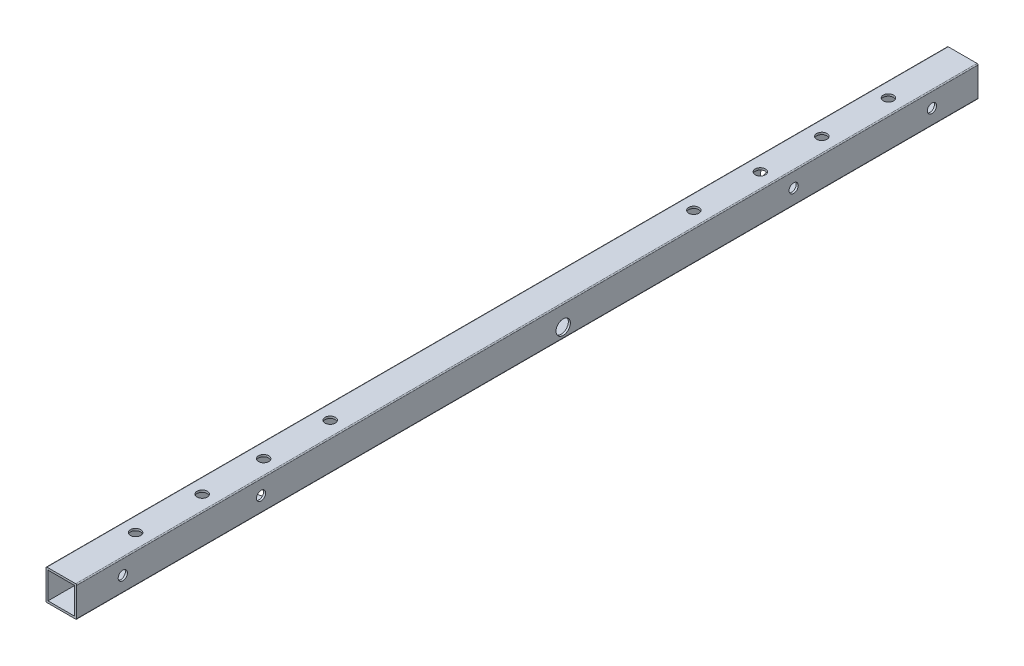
from build123d import *

# Parameters (mm, degrees)
ESQUISSE1_W             = 26
ESQUISSE1_H             = 26
BASE_EXTRU_MINCE_DEPTH  = 880
ESQUISSE2_R             = 5
ENL_V_MAT_EXTRU_1_DEPTH = 35
ESQUISSE3_R             = 4.5
ENL_V_MAT_EXTRU_2_DEPTH = 881.638972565
ESQUISSE4_R             = 7
ENL_V_MAT_EXTRU_3_DEPTH = 10


with BuildPart() as part:
    # Esquisse1 → Base-Extru.-Mince (new body)
    with BuildSketch(Plane.XY):
        with BuildLine():
            Line((14, -15), (-14, -15))
            ThreePointArc((-14, -15), (-14.707106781, -14.707106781), (-15, -14))
            Line((-15, -14), (-15, 14))
            ThreePointArc((-15, 14), (-14.707106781, 14.707106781), (-14, 15))
            Line((-14, 15), (14, 15))
            ThreePointArc((14, 15), (14.707106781, 14.707106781), (15, 14))
            Line((15, 14), (15, -14))
            ThreePointArc((15, -14), (14.707106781, -14.707106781), (14, -15))
        make_face()
        Rectangle(ESQUISSE1_W, ESQUISSE1_H, mode=Mode.SUBTRACT)
    extrude(amount=BASE_EXTRU_MINCE_DEPTH)

    # Esquisse2 → Enl_v. mat.-Extru.1 (cut)
    with BuildSketch(Plane(origin=(0, 15, 0), x_dir=(-1, 0, 0), z_dir=(0, 1, 0))):
        with Locations(Location((0, 72.5, 0), (0, 0, 90))):
            Circle(ESQUISSE2_R)
        with Locations(Location((0, 137.5, 0), (0, 0, 90))):
            Circle(ESQUISSE2_R)
        with Locations(Location((0, 742.5, 0), (0, 0, 90))):
            Circle(ESQUISSE2_R)
        with Locations(Location((0, 807.5, 0), (0, 0, 90))):
            Circle(ESQUISSE2_R)
        with Locations(Location((0, 197.5, 0), (0, 0, 90))):
            Circle(ESQUISSE2_R)
        with Locations(Location((0, 262.5, 0), (0, 0, 90))):
            Circle(ESQUISSE2_R)
        with Locations(Location((0, 617.5, 0), (0, 0, 90))):
            Circle(ESQUISSE2_R)
        with Locations(Location((0, 682.5, 0), (0, 0, 90))):
            Circle(ESQUISSE2_R)
    extrude(amount=-ENL_V_MAT_EXTRU_1_DEPTH, mode=Mode.SUBTRACT)

    # Esquisse3 → Enl_v. mat.-Extru.2 (cut, through all)
    with BuildSketch(Plane.ZY.offset(15)):
        with Locations(Location((835, 0, 0), (0, 0, 270))):
            Circle(ESQUISSE3_R)
        with Locations(Location((700, 0, 0), (0, 0, 270))):
            Circle(ESQUISSE3_R)
        with Locations(Location((45, 0, 0), (0, 0, 270))):
            Circle(ESQUISSE3_R)
        with Locations(Location((180, 0, 0), (0, 0, 270))):
            Circle(ESQUISSE3_R)
        with Locations(Location((405, -5, 0), (0, 0, 270))):
            Circle(ESQUISSE3_R)
    extrude(amount=-ENL_V_MAT_EXTRU_2_DEPTH, mode=Mode.SUBTRACT)

    # Esquisse4 → Enl_v. mat.-Extru.3 (cut)
    with BuildSketch(Plane(origin=(15, 0, 0), x_dir=(0, 0, -1), z_dir=(1, 0, 0))):
        with Locations(Location((-405, -5, 0), (0, 0, 90))):
            Circle(ESQUISSE4_R)
    extrude(amount=-ENL_V_MAT_EXTRU_3_DEPTH, mode=Mode.SUBTRACT)


solid = part.part
